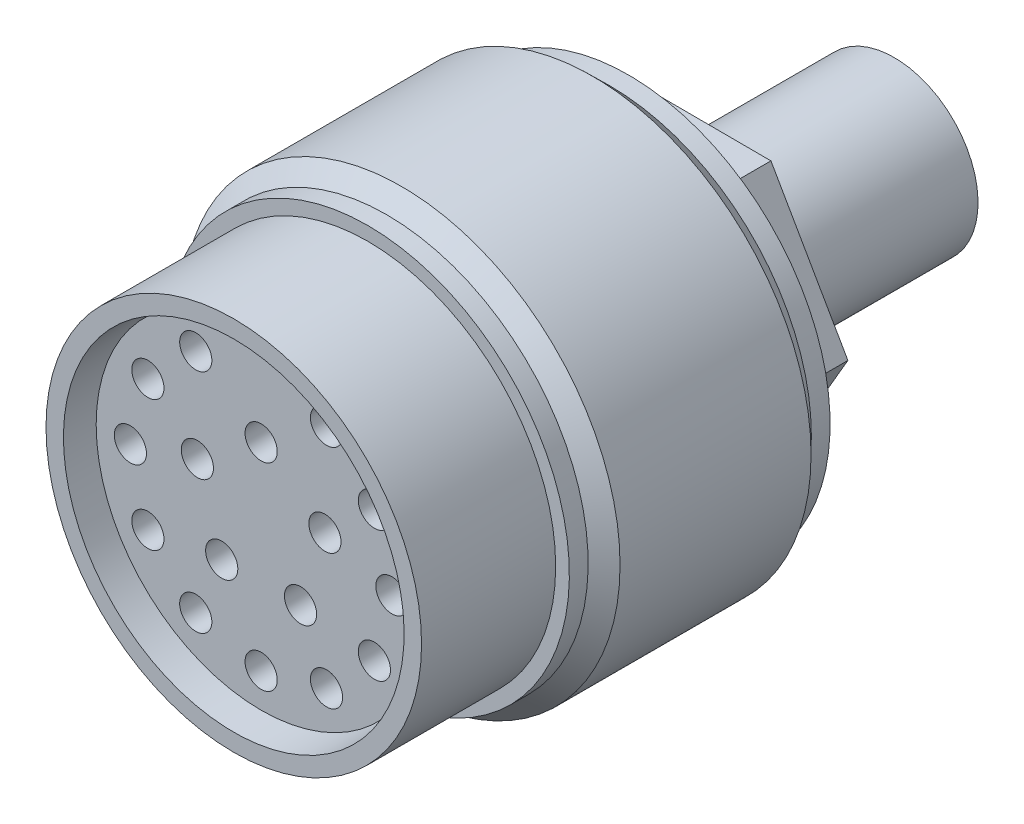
ISO-10303-21;
HEADER;
FILE_DESCRIPTION(('STEP AP214'),'2;1');
FILE_NAME('part.step','',(''),(''),'','','');
FILE_SCHEMA(('AUTOMOTIVE_DESIGN { 1 0 10303 214 1 1 1 1 }'));
ENDSEC;
DATA;
#1=APPLICATION_CONTEXT('core data for automotive mechanical design processes');
#2=APPLICATION_PROTOCOL_DEFINITION('international standard','automotive_design',2000,#1);
#3=PRODUCT_CONTEXT('',#1,'mechanical');
#4=PRODUCT('Part','Part','',(#3));
#5=PRODUCT_RELATED_PRODUCT_CATEGORY('part','',(#4));
#6=PRODUCT_DEFINITION_FORMATION('','',#4);
#7=PRODUCT_DEFINITION_CONTEXT('part definition',#1,'design');
#8=PRODUCT_DEFINITION('design','',#6,#7);
#9=PRODUCT_DEFINITION_SHAPE('','',#8);
#10=(LENGTH_UNIT() NAMED_UNIT(*) SI_UNIT(.MILLI.,.METRE.));
#11=(NAMED_UNIT(*) PLANE_ANGLE_UNIT() SI_UNIT($,.RADIAN.));
#12=(NAMED_UNIT(*) SI_UNIT($,.STERADIAN.) SOLID_ANGLE_UNIT());
#13=UNCERTAINTY_MEASURE_WITH_UNIT(LENGTH_MEASURE(1.E-05),#10,'distance_accuracy_value','');
#14=(GEOMETRIC_REPRESENTATION_CONTEXT(3) GLOBAL_UNCERTAINTY_ASSIGNED_CONTEXT((#13)) GLOBAL_UNIT_ASSIGNED_CONTEXT((#10,
#11,#12)) REPRESENTATION_CONTEXT('',''));
#15=CARTESIAN_POINT('',(0.,0.,0.));
#16=DIRECTION('',(0.,0.,1.));
#17=DIRECTION('',(1.,0.,0.));
#18=AXIS2_PLACEMENT_3D('',#15,#16,#17);
#19=CARTESIAN_POINT('',(8.03275,-8.03275,-19.05));
#20=DIRECTION('',(0.,0.,-1.));
#21=DIRECTION('',(-1.,0.,0.));
#22=AXIS2_PLACEMENT_3D('',#19,#20,#21);
#23=PLANE('',#22);
#24=CARTESIAN_POINT('',(0.,0.,-19.05));
#25=DIRECTION('',(0.,0.,1.));
#26=DIRECTION('',(0.,-1.,0.));
#27=AXIS2_PLACEMENT_3D('',#24,#25,#26);
#28=CIRCLE('',#27,7.9375);
#29=CARTESIAN_POINT('',(0.,-7.9375,-19.05));
#30=VERTEX_POINT('',#29);
#31=EDGE_CURVE('E20',#30,#30,#28,.F.);
#32=ORIENTED_EDGE('',*,*,#31,.T.);
#33=EDGE_LOOP('',(#32));
#34=FACE_BOUND('',#33,.T.);
#35=ADVANCED_FACE('F16',(#34),#23,.T.);
#36=CARTESIAN_POINT('',(0.,0.,-19.05));
#37=DIRECTION('',(0.,0.,1.));
#38=DIRECTION('',(0.,-1.,0.));
#39=AXIS2_PLACEMENT_3D('',#36,#37,#38);
#40=CYLINDRICAL_SURFACE('',#39,7.9375);
#41=ORIENTED_EDGE('',*,*,#31,.F.);
#42=EDGE_LOOP('',(#41));
#43=FACE_BOUND('',#42,.T.);
#44=CARTESIAN_POINT('',(0.,0.,-2.54));
#45=DIRECTION('',(0.,0.,1.));
#46=DIRECTION('',(0.,-1.,0.));
#47=AXIS2_PLACEMENT_3D('',#44,#45,#46);
#48=CIRCLE('',#47,7.9375);
#49=CARTESIAN_POINT('',(0.,-7.9375,-2.54));
#50=VERTEX_POINT('',#49);
#51=EDGE_CURVE('E274',#50,#50,#48,.F.);
#52=ORIENTED_EDGE('',*,*,#51,.T.);
#53=EDGE_LOOP('',(#52));
#54=FACE_BOUND('',#53,.T.);
#55=ADVANCED_FACE('F284',(#43,#54),#40,.T.);
#56=CARTESIAN_POINT('',(8.03275,-8.03275,-2.54));
#57=DIRECTION('',(0.,0.,-1.));
#58=DIRECTION('',(-1.,0.,0.));
#59=AXIS2_PLACEMENT_3D('',#56,#57,#58);
#60=PLANE('',#59);
#61=CARTESIAN_POINT('',(0.,0.,-2.54));
#62=DIRECTION('',(0.,0.,1.));
#63=DIRECTION('',(1.,0.,0.));
#64=AXIS2_PLACEMENT_3D('',#61,#62,#63);
#65=CIRCLE('',#64,7.62);
#66=CARTESIAN_POINT('',(7.62,0.,-2.54));
#67=VERTEX_POINT('',#66);
#68=EDGE_CURVE('E271',#67,#67,#65,.F.);
#69=ORIENTED_EDGE('',*,*,#68,.T.);
#70=EDGE_LOOP('',(#69));
#71=FACE_BOUND('',#70,.T.);
#72=ORIENTED_EDGE('',*,*,#51,.F.);
#73=EDGE_LOOP('',(#72));
#74=FACE_BOUND('',#73,.T.);
#75=ADVANCED_FACE('F286',(#71,#74),#60,.F.);
#76=CARTESIAN_POINT('',(0.,0.,-2.54));
#77=DIRECTION('',(0.,0.,1.));
#78=DIRECTION('',(1.,0.,0.));
#79=AXIS2_PLACEMENT_3D('',#76,#77,#78);
#80=CYLINDRICAL_SURFACE('',#79,7.62);
#81=CARTESIAN_POINT('',(0.,0.,0.));
#82=DIRECTION('',(0.,0.,1.));
#83=DIRECTION('',(1.,0.,0.));
#84=AXIS2_PLACEMENT_3D('',#81,#82,#83);
#85=CIRCLE('',#84,7.62);
#86=CARTESIAN_POINT('',(7.62,0.,0.));
#87=VERTEX_POINT('',#86);
#88=EDGE_CURVE('E93',#87,#87,#85,.T.);
#89=ORIENTED_EDGE('',*,*,#88,.F.);
#90=EDGE_LOOP('',(#89));
#91=FACE_BOUND('',#90,.T.);
#92=ORIENTED_EDGE('',*,*,#68,.F.);
#93=EDGE_LOOP('',(#92));
#94=FACE_BOUND('',#93,.T.);
#95=ADVANCED_FACE('F293',(#91,#94),#80,.T.);
#96=CARTESIAN_POINT('',(14.840580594,-12.878533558,0.));
#97=DIRECTION('',(0.,0.,-1.));
#98=DIRECTION('',(-1.,0.,0.));
#99=AXIS2_PLACEMENT_3D('',#96,#97,#98);
#100=PLANE('',#99);
#101=ORIENTED_EDGE('',*,*,#88,.T.);
#102=EDGE_LOOP('',(#101));
#103=FACE_BOUND('',#102,.T.);
#104=DIRECTION('',(0.496937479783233,-0.867786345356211,0.));
#105=VECTOR('',#104,1.);
#106=CARTESIAN_POINT('',(11.020886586,6.311105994,0.));
#107=LINE('',#106,#105);
#108=CARTESIAN_POINT('',(7.37716783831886,12.6740178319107,0.));
#109=VERTEX_POINT('',#108);
#110=CARTESIAN_POINT('',(14.6646053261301,-0.0518058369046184,0.));
#111=VERTEX_POINT('',#110);
#112=EDGE_CURVE('E112',#109,#111,#107,.T.);
#113=ORIENTED_EDGE('',*,*,#112,.T.);
#114=DIRECTION('',(-0.503056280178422,-0.864253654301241,0.));
#115=VECTOR('',#114,1.);
#116=CARTESIAN_POINT('',(10.9760214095,-6.3888147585,0.));
#117=LINE('',#116,#115);
#118=CARTESIAN_POINT('',(7.28743748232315,-12.7258236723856,0.));
#119=VERTEX_POINT('',#118);
#120=EDGE_CURVE('E121',#111,#119,#117,.T.);
#121=ORIENTED_EDGE('',*,*,#120,.T.);
#122=DIRECTION('',(-0.999993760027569,0.0035326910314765,0.));
#123=VECTOR('',#122,1.);
#124=CARTESIAN_POINT('',(-0.0448651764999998,-12.6999207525,0.));
#125=LINE('',#124,#123);
#126=CARTESIAN_POINT('',(-7.37716783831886,-12.6740178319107,0.));
#127=VERTEX_POINT('',#126);
#128=EDGE_CURVE('E120',#119,#127,#125,.T.);
#129=ORIENTED_EDGE('',*,*,#128,.T.);
#130=DIRECTION('',(-0.496937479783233,0.867786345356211,0.));
#131=VECTOR('',#130,1.);
#132=CARTESIAN_POINT('',(-11.020886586,-6.311105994,0.));
#133=LINE('',#132,#131);
#134=CARTESIAN_POINT('',(-14.6646053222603,0.0518058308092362,0.));
#135=VERTEX_POINT('',#134);
#136=EDGE_CURVE('E73',#127,#135,#133,.T.);
#137=ORIENTED_EDGE('',*,*,#136,.T.);
#138=DIRECTION('',(0.503056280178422,0.864253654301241,0.));
#139=VECTOR('',#138,1.);
#140=CARTESIAN_POINT('',(-10.9760214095,6.3888147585,0.));
#141=LINE('',#140,#139);
#142=CARTESIAN_POINT('',(-7.28743748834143,12.7258236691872,0.));
#143=VERTEX_POINT('',#142);
#144=EDGE_CURVE('E88',#135,#143,#141,.T.);
#145=ORIENTED_EDGE('',*,*,#144,.T.);
#146=DIRECTION('',(0.999993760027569,-0.0035326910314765,0.));
#147=VECTOR('',#146,1.);
#148=CARTESIAN_POINT('',(0.0448651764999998,12.6999207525,0.));
#149=LINE('',#148,#147);
#150=EDGE_CURVE('E86',#143,#109,#149,.T.);
#151=ORIENTED_EDGE('',*,*,#150,.T.);
#152=EDGE_LOOP('',(#113,#121,#129,#137,#145,#151));
#153=FACE_BOUND('',#152,.T.);
#154=ADVANCED_FACE('F90',(#103,#153),#100,.T.);
#155=CARTESIAN_POINT('',(-14.66460533,0.051805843,0.));
#156=DIRECTION('',(0.864253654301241,-0.503056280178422,0.));
#157=DIRECTION('',(0.503056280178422,0.864253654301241,0.));
#158=AXIS2_PLACEMENT_3D('',#155,#156,#157);
#159=PLANE('',#158);
#160=DIRECTION('',(0.,0.,-1.));
#161=VECTOR('',#160,1.);
#162=CARTESIAN_POINT('',(-7.287437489,12.725823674,3.048));
#163=LINE('',#162,#161);
#164=CARTESIAN_POINT('',(-7.287437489,12.725823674,6.096));
#165=VERTEX_POINT('',#164);
#166=EDGE_CURVE('E92',#165,#143,#163,.T.);
#167=ORIENTED_EDGE('',*,*,#166,.T.);
#168=ORIENTED_EDGE('',*,*,#144,.F.);
#169=DIRECTION('',(0.,0.,1.));
#170=VECTOR('',#169,1.);
#171=CARTESIAN_POINT('',(-14.66460533,0.051805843,3.048));
#172=LINE('',#171,#170);
#173=CARTESIAN_POINT('',(-14.66460533,0.0518058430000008,6.096));
#174=VERTEX_POINT('',#173);
#175=EDGE_CURVE('E62',#135,#174,#172,.T.);
#176=ORIENTED_EDGE('',*,*,#175,.T.);
#177=DIRECTION('',(0.503056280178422,0.864253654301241,0.));
#178=VECTOR('',#177,1.);
#179=CARTESIAN_POINT('',(-14.66460533,0.051805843,6.096));
#180=LINE('',#179,#178);
#181=EDGE_CURVE('E98',#174,#165,#180,.T.);
#182=ORIENTED_EDGE('',*,*,#181,.T.);
#183=EDGE_LOOP('',(#167,#168,#176,#182));
#184=FACE_BOUND('',#183,.T.);
#185=ADVANCED_FACE('F96',(#184),#159,.F.);
#186=CARTESIAN_POINT('',(-7.287437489,12.725823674,0.));
#187=DIRECTION('',(-0.0035326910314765,-0.999993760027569,0.));
#188=DIRECTION('',(0.999993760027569,-0.0035326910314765,0.));
#189=AXIS2_PLACEMENT_3D('',#186,#187,#188);
#190=PLANE('',#189);
#191=DIRECTION('',(0.,0.,-1.));
#192=VECTOR('',#191,1.);
#193=CARTESIAN_POINT('',(7.377167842,12.674017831,3.048));
#194=LINE('',#193,#192);
#195=CARTESIAN_POINT('',(7.377167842,12.674017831,6.096));
#196=VERTEX_POINT('',#195);
#197=EDGE_CURVE('E105',#196,#109,#194,.T.);
#198=ORIENTED_EDGE('',*,*,#197,.T.);
#199=ORIENTED_EDGE('',*,*,#150,.F.);
#200=ORIENTED_EDGE('',*,*,#166,.F.);
#201=DIRECTION('',(0.999993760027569,-0.0035326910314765,0.));
#202=VECTOR('',#201,1.);
#203=CARTESIAN_POINT('',(-7.287437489,12.725823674,6.096));
#204=LINE('',#203,#202);
#205=EDGE_CURVE('E264',#165,#196,#204,.T.);
#206=ORIENTED_EDGE('',*,*,#205,.T.);
#207=EDGE_LOOP('',(#198,#199,#200,#206));
#208=FACE_BOUND('',#207,.T.);
#209=ADVANCED_FACE('F103',(#208),#190,.F.);
#210=CARTESIAN_POINT('',(7.377167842,12.674017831,0.));
#211=DIRECTION('',(-0.867786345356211,-0.496937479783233,0.));
#212=DIRECTION('',(0.496937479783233,-0.867786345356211,0.));
#213=AXIS2_PLACEMENT_3D('',#210,#211,#212);
#214=PLANE('',#213);
#215=DIRECTION('',(0.,0.,-1.));
#216=VECTOR('',#215,1.);
#217=CARTESIAN_POINT('',(14.66460533,-0.051805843,3.048));
#218=LINE('',#217,#216);
#219=CARTESIAN_POINT('',(14.66460533,-0.0518058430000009,6.096));
#220=VERTEX_POINT('',#219);
#221=EDGE_CURVE('E125',#220,#111,#218,.T.);
#222=ORIENTED_EDGE('',*,*,#221,.T.);
#223=ORIENTED_EDGE('',*,*,#112,.F.);
#224=ORIENTED_EDGE('',*,*,#197,.F.);
#225=DIRECTION('',(0.496937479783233,-0.867786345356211,0.));
#226=VECTOR('',#225,1.);
#227=CARTESIAN_POINT('',(7.377167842,12.674017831,6.096));
#228=LINE('',#227,#226);
#229=EDGE_CURVE('E261',#196,#220,#228,.T.);
#230=ORIENTED_EDGE('',*,*,#229,.T.);
#231=EDGE_LOOP('',(#222,#223,#224,#230));
#232=FACE_BOUND('',#231,.T.);
#233=ADVANCED_FACE('F423',(#232),#214,.F.);
#234=CARTESIAN_POINT('',(14.66460533,-0.051805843,0.));
#235=DIRECTION('',(-0.864253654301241,0.503056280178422,0.));
#236=DIRECTION('',(-0.503056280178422,-0.864253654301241,0.));
#237=AXIS2_PLACEMENT_3D('',#234,#235,#236);
#238=PLANE('',#237);
#239=DIRECTION('',(0.,0.,-1.));
#240=VECTOR('',#239,1.);
#241=CARTESIAN_POINT('',(7.287437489,-12.725823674,3.048));
#242=LINE('',#241,#240);
#243=CARTESIAN_POINT('',(7.287437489,-12.725823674,6.096));
#244=VERTEX_POINT('',#243);
#245=EDGE_CURVE('E117',#244,#119,#242,.T.);
#246=ORIENTED_EDGE('',*,*,#245,.T.);
#247=ORIENTED_EDGE('',*,*,#120,.F.);
#248=ORIENTED_EDGE('',*,*,#221,.F.);
#249=DIRECTION('',(-0.503056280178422,-0.864253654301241,0.));
#250=VECTOR('',#249,1.);
#251=CARTESIAN_POINT('',(14.66460533,-0.051805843,6.096));
#252=LINE('',#251,#250);
#253=EDGE_CURVE('E258',#220,#244,#252,.T.);
#254=ORIENTED_EDGE('',*,*,#253,.T.);
#255=EDGE_LOOP('',(#246,#247,#248,#254));
#256=FACE_BOUND('',#255,.T.);
#257=ADVANCED_FACE('F426',(#256),#238,.F.);
#258=CARTESIAN_POINT('',(7.287437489,-12.725823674,0.));
#259=DIRECTION('',(0.0035326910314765,0.999993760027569,0.));
#260=DIRECTION('',(-0.999993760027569,0.0035326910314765,0.));
#261=AXIS2_PLACEMENT_3D('',#258,#259,#260);
#262=PLANE('',#261);
#263=DIRECTION('',(0.,0.,-1.));
#264=VECTOR('',#263,1.);
#265=CARTESIAN_POINT('',(-7.377167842,-12.674017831,3.048));
#266=LINE('',#265,#264);
#267=CARTESIAN_POINT('',(-7.377167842,-12.674017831,6.096));
#268=VERTEX_POINT('',#267);
#269=EDGE_CURVE('E122',#268,#127,#266,.T.);
#270=ORIENTED_EDGE('',*,*,#269,.T.);
#271=ORIENTED_EDGE('',*,*,#128,.F.);
#272=ORIENTED_EDGE('',*,*,#245,.F.);
#273=DIRECTION('',(-0.999993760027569,0.0035326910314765,0.));
#274=VECTOR('',#273,1.);
#275=CARTESIAN_POINT('',(7.287437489,-12.725823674,6.096));
#276=LINE('',#275,#274);
#277=EDGE_CURVE('E39',#244,#268,#276,.T.);
#278=ORIENTED_EDGE('',*,*,#277,.T.);
#279=EDGE_LOOP('',(#270,#271,#272,#278));
#280=FACE_BOUND('',#279,.T.);
#281=ADVANCED_FACE('F430',(#280),#262,.F.);
#282=CARTESIAN_POINT('',(-7.377167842,-12.674017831,0.));
#283=DIRECTION('',(0.867786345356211,0.496937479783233,0.));
#284=DIRECTION('',(-0.496937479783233,0.867786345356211,0.));
#285=AXIS2_PLACEMENT_3D('',#282,#283,#284);
#286=PLANE('',#285);
#287=ORIENTED_EDGE('',*,*,#175,.F.);
#288=ORIENTED_EDGE('',*,*,#136,.F.);
#289=ORIENTED_EDGE('',*,*,#269,.F.);
#290=DIRECTION('',(-0.496937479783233,0.867786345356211,0.));
#291=VECTOR('',#290,1.);
#292=CARTESIAN_POINT('',(-7.377167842,-12.674017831,6.096));
#293=LINE('',#292,#291);
#294=EDGE_CURVE('E253',#268,#174,#293,.T.);
#295=ORIENTED_EDGE('',*,*,#294,.T.);
#296=EDGE_LOOP('',(#287,#288,#289,#295));
#297=FACE_BOUND('',#296,.T.);
#298=ADVANCED_FACE('F434',(#297),#286,.F.);
#299=CARTESIAN_POINT('',(-19.3043048,-19.3043048,6.096));
#300=DIRECTION('',(0.,0.,1.));
#301=DIRECTION('',(1.,0.,0.));
#302=AXIS2_PLACEMENT_3D('',#299,#300,#301);
#303=PLANE('',#302);
#304=ORIENTED_EDGE('',*,*,#277,.F.);
#305=ORIENTED_EDGE('',*,*,#253,.F.);
#306=ORIENTED_EDGE('',*,*,#229,.F.);
#307=ORIENTED_EDGE('',*,*,#205,.F.);
#308=ORIENTED_EDGE('',*,*,#181,.F.);
#309=ORIENTED_EDGE('',*,*,#294,.F.);
#310=EDGE_LOOP('',(#304,#305,#306,#307,#308,#309));
#311=FACE_BOUND('',#310,.T.);
#312=CARTESIAN_POINT('',(0.,0.,6.096));
#313=DIRECTION('',(0.,0.,-1.));
#314=DIRECTION('',(-1.,0.,0.));
#315=AXIS2_PLACEMENT_3D('',#312,#313,#314);
#316=CIRCLE('',#315,19.0754);
#317=CARTESIAN_POINT('',(-19.0754,0.,6.096));
#318=VERTEX_POINT('',#317);
#319=EDGE_CURVE('E248',#318,#318,#316,.T.);
#320=ORIENTED_EDGE('',*,*,#319,.T.);
#321=EDGE_LOOP('',(#320));
#322=FACE_BOUND('',#321,.T.);
#323=ADVANCED_FACE('F403',(#311,#322),#303,.F.);
#324=CARTESIAN_POINT('',(0.,0.,7.874));
#325=DIRECTION('',(0.,0.,-1.));
#326=DIRECTION('',(-1.,0.,0.));
#327=AXIS2_PLACEMENT_3D('',#324,#325,#326);
#328=CYLINDRICAL_SURFACE('',#327,19.0754);
#329=ORIENTED_EDGE('',*,*,#319,.F.);
#330=EDGE_LOOP('',(#329));
#331=FACE_BOUND('',#330,.T.);
#332=CARTESIAN_POINT('',(0.,0.,7.87400000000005));
#333=DIRECTION('',(0.,0.,1.));
#334=DIRECTION('',(1.,0.,0.));
#335=AXIS2_PLACEMENT_3D('',#332,#333,#334);
#336=CIRCLE('',#335,19.0754);
#337=CARTESIAN_POINT('',(19.0754,0.,7.874));
#338=VERTEX_POINT('',#337);
#339=EDGE_CURVE('E252',#338,#338,#336,.F.);
#340=ORIENTED_EDGE('',*,*,#339,.T.);
#341=EDGE_LOOP('',(#340));
#342=FACE_BOUND('',#341,.T.);
#343=ADVANCED_FACE('F400',(#331,#342),#328,.T.);
#344=CARTESIAN_POINT('',(0.,0.,7.874));
#345=DIRECTION('',(0.,0.,1.));
#346=DIRECTION('',(1.,0.,0.));
#347=AXIS2_PLACEMENT_3D('',#344,#345,#346);
#348=CONICAL_SURFACE('',#347,19.0754,0.777646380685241);
#349=CARTESIAN_POINT('',(0.,0.,9.525));
#350=DIRECTION('',(0.,0.,-1.));
#351=DIRECTION('',(-1.,0.,0.));
#352=AXIS2_PLACEMENT_3D('',#349,#350,#351);
#353=CIRCLE('',#352,20.701);
#354=CARTESIAN_POINT('',(-20.701,0.,9.525));
#355=VERTEX_POINT('',#354);
#356=EDGE_CURVE('E927',#355,#355,#353,.T.);
#357=ORIENTED_EDGE('',*,*,#356,.T.);
#358=EDGE_LOOP('',(#357));
#359=FACE_BOUND('',#358,.T.);
#360=ORIENTED_EDGE('',*,*,#339,.F.);
#361=EDGE_LOOP('',(#360));
#362=FACE_BOUND('',#361,.T.);
#363=ADVANCED_FACE('F396',(#359,#362),#348,.T.);
#364=CARTESIAN_POINT('',(0.,0.,27.6098));
#365=DIRECTION('',(0.,0.,-1.));
#366=DIRECTION('',(-1.,0.,0.));
#367=AXIS2_PLACEMENT_3D('',#364,#365,#366);
#368=CYLINDRICAL_SURFACE('',#367,20.701);
#369=ORIENTED_EDGE('',*,*,#356,.F.);
#370=EDGE_LOOP('',(#369));
#371=FACE_BOUND('',#370,.T.);
#372=CARTESIAN_POINT('',(0.,0.,27.6098));
#373=DIRECTION('',(0.,0.,-1.));
#374=DIRECTION('',(-1.,0.,0.));
#375=AXIS2_PLACEMENT_3D('',#372,#373,#374);
#376=CIRCLE('',#375,20.701);
#377=CARTESIAN_POINT('',(-20.701,0.,27.6098));
#378=VERTEX_POINT('',#377);
#379=EDGE_CURVE('E931',#378,#378,#376,.T.);
#380=ORIENTED_EDGE('',*,*,#379,.T.);
#381=EDGE_LOOP('',(#380));
#382=FACE_BOUND('',#381,.T.);
#383=ADVANCED_FACE('F392',(#371,#382),#368,.T.);
#384=CARTESIAN_POINT('',(0.,0.,29.0068));
#385=DIRECTION('',(0.,0.,-1.));
#386=DIRECTION('',(-1.,0.,0.));
#387=AXIS2_PLACEMENT_3D('',#384,#385,#386);
#388=CONICAL_SURFACE('',#387,19.0754,0.860884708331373);
#389=ORIENTED_EDGE('',*,*,#379,.F.);
#390=EDGE_LOOP('',(#389));
#391=FACE_BOUND('',#390,.T.);
#392=CARTESIAN_POINT('',(0.,0.,29.0068));
#393=DIRECTION('',(0.,0.,-1.));
#394=DIRECTION('',(-1.,0.,0.));
#395=AXIS2_PLACEMENT_3D('',#392,#393,#394);
#396=CIRCLE('',#395,19.0754);
#397=CARTESIAN_POINT('',(-19.0754,0.,29.0068));
#398=VERTEX_POINT('',#397);
#399=EDGE_CURVE('E247',#398,#398,#396,.T.);
#400=ORIENTED_EDGE('',*,*,#399,.T.);
#401=EDGE_LOOP('',(#400));
#402=FACE_BOUND('',#401,.T.);
#403=ADVANCED_FACE('F388',(#391,#402),#388,.T.);
#404=CARTESIAN_POINT('',(0.,0.,30.7848));
#405=DIRECTION('',(0.,0.,-1.));
#406=DIRECTION('',(0.,1.,0.));
#407=AXIS2_PLACEMENT_3D('',#404,#405,#406);
#408=CYLINDRICAL_SURFACE('',#407,19.0754);
#409=ORIENTED_EDGE('',*,*,#399,.F.);
#410=EDGE_LOOP('',(#409));
#411=FACE_BOUND('',#410,.T.);
#412=CARTESIAN_POINT('',(0.,0.,30.7848));
#413=DIRECTION('',(0.,0.,-1.));
#414=DIRECTION('',(0.,1.,0.));
#415=AXIS2_PLACEMENT_3D('',#412,#413,#414);
#416=CIRCLE('',#415,19.0754);
#417=CARTESIAN_POINT('',(0.,19.0754,30.7848));
#418=VERTEX_POINT('',#417);
#419=EDGE_CURVE('E244',#418,#418,#416,.T.);
#420=ORIENTED_EDGE('',*,*,#419,.T.);
#421=EDGE_LOOP('',(#420));
#422=FACE_BOUND('',#421,.T.);
#423=ADVANCED_FACE('F385',(#411,#422),#408,.T.);
#424=CARTESIAN_POINT('',(19.3043048,-19.3043048,30.7848));
#425=DIRECTION('',(0.,0.,-1.));
#426=DIRECTION('',(-1.,0.,0.));
#427=AXIS2_PLACEMENT_3D('',#424,#425,#426);
#428=PLANE('',#427);
#429=CARTESIAN_POINT('',(0.,0.,30.7848));
#430=DIRECTION('',(0.,0.,-1.));
#431=DIRECTION('',(0.,1.,0.));
#432=AXIS2_PLACEMENT_3D('',#429,#430,#431);
#433=CIRCLE('',#432,17.78);
#434=CARTESIAN_POINT('',(0.,17.78,30.7848));
#435=VERTEX_POINT('',#434);
#436=EDGE_CURVE('E241',#435,#435,#433,.T.);
#437=ORIENTED_EDGE('',*,*,#436,.T.);
#438=EDGE_LOOP('',(#437));
#439=FACE_BOUND('',#438,.T.);
#440=ORIENTED_EDGE('',*,*,#419,.F.);
#441=EDGE_LOOP('',(#440));
#442=FACE_BOUND('',#441,.T.);
#443=ADVANCED_FACE('F383',(#439,#442),#428,.F.);
#444=CARTESIAN_POINT('',(0.,0.,43.4848));
#445=DIRECTION('',(0.,0.,-1.));
#446=DIRECTION('',(0.,1.,0.));
#447=AXIS2_PLACEMENT_3D('',#444,#445,#446);
#448=CYLINDRICAL_SURFACE('',#447,17.78);
#449=ORIENTED_EDGE('',*,*,#436,.F.);
#450=EDGE_LOOP('',(#449));
#451=FACE_BOUND('',#450,.T.);
#452=CARTESIAN_POINT('',(0.,0.,43.4848));
#453=DIRECTION('',(0.,0.,-1.));
#454=DIRECTION('',(0.,1.,0.));
#455=AXIS2_PLACEMENT_3D('',#452,#453,#454);
#456=CIRCLE('',#455,17.78);
#457=CARTESIAN_POINT('',(0.,17.78,43.4848));
#458=VERTEX_POINT('',#457);
#459=EDGE_CURVE('E238',#458,#458,#456,.T.);
#460=ORIENTED_EDGE('',*,*,#459,.T.);
#461=EDGE_LOOP('',(#460));
#462=FACE_BOUND('',#461,.T.);
#463=ADVANCED_FACE('F379',(#451,#462),#448,.T.);
#464=CARTESIAN_POINT('',(17.99336,-17.99336,43.4848));
#465=DIRECTION('',(0.,0.,-1.));
#466=DIRECTION('',(-1.,0.,0.));
#467=AXIS2_PLACEMENT_3D('',#464,#465,#466);
#468=PLANE('',#467);
#469=CARTESIAN_POINT('',(0.,0.,43.4848));
#470=DIRECTION('',(0.,0.,-1.));
#471=DIRECTION('',(0.,1.,0.));
#472=AXIS2_PLACEMENT_3D('',#469,#470,#471);
#473=CIRCLE('',#472,16.129);
#474=CARTESIAN_POINT('',(0.,16.129,43.4848));
#475=VERTEX_POINT('',#474);
#476=EDGE_CURVE('E235',#475,#475,#473,.F.);
#477=ORIENTED_EDGE('',*,*,#476,.F.);
#478=EDGE_LOOP('',(#477));
#479=FACE_BOUND('',#478,.T.);
#480=ORIENTED_EDGE('',*,*,#459,.F.);
#481=EDGE_LOOP('',(#480));
#482=FACE_BOUND('',#481,.T.);
#483=ADVANCED_FACE('F382',(#479,#482),#468,.F.);
#484=CARTESIAN_POINT('',(4.095812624,2.952467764,24.384));
#485=DIRECTION('',(0.,0.,1.));
#486=DIRECTION('',(0.309016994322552,-0.951056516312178,0.));
#487=AXIS2_PLACEMENT_3D('',#484,#485,#486);
#488=PLANE('',#487);
#489=CARTESIAN_POINT('',(6.039208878,1.962257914,24.384));
#490=DIRECTION('',(0.,0.,1.));
#491=DIRECTION('',(1.,0.,0.));
#492=AXIS2_PLACEMENT_3D('',#489,#490,#491);
#493=CIRCLE('',#492,1.524);
#494=CARTESIAN_POINT('',(7.563208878,1.962257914,24.384));
#495=VERTEX_POINT('',#494);
#496=EDGE_CURVE('E232',#495,#495,#493,.F.);
#497=ORIENTED_EDGE('',*,*,#496,.F.);
#498=EDGE_LOOP('',(#497));
#499=FACE_BOUND('',#498,.T.);
#500=ADVANCED_FACE('F446',(#499),#488,.T.);
#501=CARTESIAN_POINT('',(4.073639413,-2.982986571,24.384));
#502=DIRECTION('',(0.,0.,1.));
#503=DIRECTION('',(-0.809016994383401,-0.587785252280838,0.));
#504=AXIS2_PLACEMENT_3D('',#501,#502,#503);
#505=PLANE('',#504);
#506=CARTESIAN_POINT('',(3.732436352,-5.137257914,24.384));
#507=DIRECTION('',(0.,0.,1.));
#508=DIRECTION('',(1.,0.,0.));
#509=AXIS2_PLACEMENT_3D('',#506,#507,#508);
#510=CIRCLE('',#509,1.524);
#511=CARTESIAN_POINT('',(5.256436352,-5.137257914,24.384));
#512=VERTEX_POINT('',#511);
#513=EDGE_CURVE('E229',#512,#512,#510,.F.);
#514=ORIENTED_EDGE('',*,*,#513,.F.);
#515=EDGE_LOOP('',(#514));
#516=FACE_BOUND('',#515,.T.);
#517=ADVANCED_FACE('F450',(#516),#505,.T.);
#518=CARTESIAN_POINT('',(-1.578165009,-4.796054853,24.384));
#519=DIRECTION('',(0.,0.,1.));
#520=DIRECTION('',(-0.809016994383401,0.587785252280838,0.));
#521=AXIS2_PLACEMENT_3D('',#518,#519,#520);
#522=PLANE('',#521);
#523=CARTESIAN_POINT('',(-3.732436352,-5.137257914,24.384));
#524=DIRECTION('',(0.,0.,1.));
#525=DIRECTION('',(1.,0.,0.));
#526=AXIS2_PLACEMENT_3D('',#523,#524,#525);
#527=CIRCLE('',#526,1.524);
#528=CARTESIAN_POINT('',(-2.208436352,-5.137257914,24.384));
#529=VERTEX_POINT('',#528);
#530=EDGE_CURVE('E226',#529,#529,#527,.F.);
#531=ORIENTED_EDGE('',*,*,#530,.F.);
#532=EDGE_LOOP('',(#531));
#533=FACE_BOUND('',#532,.T.);
#534=ADVANCED_FACE('F454',(#533),#522,.T.);
#535=CARTESIAN_POINT('',(-5.048999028,0.01886166,24.384));
#536=DIRECTION('',(0.,0.,1.));
#537=DIRECTION('',(0.309016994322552,0.951056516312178,0.));
#538=AXIS2_PLACEMENT_3D('',#535,#536,#537);
#539=PLANE('',#538);
#540=CARTESIAN_POINT('',(-6.039208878,1.962257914,24.384));
#541=DIRECTION('',(0.,0.,1.));
#542=DIRECTION('',(1.,0.,0.));
#543=AXIS2_PLACEMENT_3D('',#540,#541,#542);
#544=CIRCLE('',#543,1.524);
#545=CARTESIAN_POINT('',(-4.515208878,1.962257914,24.384));
#546=VERTEX_POINT('',#545);
#547=EDGE_CURVE('E223',#546,#546,#544,.F.);
#548=ORIENTED_EDGE('',*,*,#547,.F.);
#549=EDGE_LOOP('',(#548));
#550=FACE_BOUND('',#549,.T.);
#551=ADVANCED_FACE('F458',(#550),#539,.T.);
#552=CARTESIAN_POINT('',(-1.542288,4.807712,24.384));
#553=DIRECTION('',(0.,0.,1.));
#554=DIRECTION('',(1.,0.,0.));
#555=AXIS2_PLACEMENT_3D('',#552,#553,#554);
#556=PLANE('',#555);
#557=CARTESIAN_POINT('',(0.,6.35,24.384));
#558=DIRECTION('',(0.,0.,1.));
#559=DIRECTION('',(1.,0.,0.));
#560=AXIS2_PLACEMENT_3D('',#557,#558,#559);
#561=CIRCLE('',#560,1.524);
#562=CARTESIAN_POINT('',(1.524,6.35,24.384));
#563=VERTEX_POINT('',#562);
#564=EDGE_CURVE('E220',#563,#563,#561,.F.);
#565=ORIENTED_EDGE('',*,*,#564,.F.);
#566=EDGE_LOOP('',(#565));
#567=FACE_BOUND('',#566,.T.);
#568=ADVANCED_FACE('F462',(#567),#556,.T.);
#569=CARTESIAN_POINT('',(5.626733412,-12.83036415,24.384));
#570=DIRECTION('',(0.,0.,1.));
#571=DIRECTION('',(0.866025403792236,0.499999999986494,0.));
#572=AXIS2_PLACEMENT_3D('',#569,#570,#571);
#573=PLANE('',#572);
#574=CARTESIAN_POINT('',(6.19125,-10.723559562,24.384));
#575=DIRECTION('',(0.,0.,1.));
#576=DIRECTION('',(1.,0.,0.));
#577=AXIS2_PLACEMENT_3D('',#574,#575,#576);
#578=CIRCLE('',#577,1.524);
#579=CARTESIAN_POINT('',(7.71525,-10.723559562,24.384));
#580=VERTEX_POINT('',#579);
#581=EDGE_CURVE('E217',#580,#580,#578,.F.);
#582=ORIENTED_EDGE('',*,*,#581,.F.);
#583=EDGE_LOOP('',(#582));
#584=FACE_BOUND('',#583,.T.);
#585=ADVANCED_FACE('F466',(#584),#573,.T.);
#586=CARTESIAN_POINT('',(11.28807615,-8.298054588,24.384));
#587=DIRECTION('',(0.,0.,1.));
#588=DIRECTION('',(0.499999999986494,0.866025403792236,0.));
#589=AXIS2_PLACEMENT_3D('',#586,#587,#588);
#590=PLANE('',#589);
#591=CARTESIAN_POINT('',(10.723559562,-6.19125,24.384));
#592=DIRECTION('',(0.,0.,1.));
#593=DIRECTION('',(1.,0.,0.));
#594=AXIS2_PLACEMENT_3D('',#591,#592,#593);
#595=CIRCLE('',#594,1.524);
#596=CARTESIAN_POINT('',(12.247559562,-6.19125,24.384));
#597=VERTEX_POINT('',#596);
#598=EDGE_CURVE('E213',#597,#597,#595,.F.);
#599=ORIENTED_EDGE('',*,*,#598,.F.);
#600=EDGE_LOOP('',(#599));
#601=FACE_BOUND('',#600,.T.);
#602=ADVANCED_FACE('F470',(#601),#590,.T.);
#603=CARTESIAN_POINT('',(13.924788,-1.542288,24.384));
#604=DIRECTION('',(0.,0.,1.));
#605=DIRECTION('',(0.,1.,0.));
#606=AXIS2_PLACEMENT_3D('',#603,#604,#605);
#607=PLANE('',#606);
#608=CARTESIAN_POINT('',(12.3825,0.,24.384));
#609=DIRECTION('',(0.,0.,1.));
#610=DIRECTION('',(1.,0.,0.));
#611=AXIS2_PLACEMENT_3D('',#608,#609,#610);
#612=CIRCLE('',#611,1.524);
#613=CARTESIAN_POINT('',(13.9065,0.,24.384));
#614=VERTEX_POINT('',#613);
#615=EDGE_CURVE('E210',#614,#614,#612,.F.);
#616=ORIENTED_EDGE('',*,*,#615,.F.);
#617=EDGE_LOOP('',(#616));
#618=FACE_BOUND('',#617,.T.);
#619=ADVANCED_FACE('F474',(#618),#607,.T.);
#620=CARTESIAN_POINT('',(12.83036415,5.626733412,24.384));
#621=DIRECTION('',(0.,0.,1.));
#622=DIRECTION('',(-0.499999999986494,0.866025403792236,0.));
#623=AXIS2_PLACEMENT_3D('',#620,#621,#622);
#624=PLANE('',#623);
#625=CARTESIAN_POINT('',(10.723559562,6.19125,24.384));
#626=DIRECTION('',(0.,0.,1.));
#627=DIRECTION('',(1.,0.,0.));
#628=AXIS2_PLACEMENT_3D('',#625,#626,#627);
#629=CIRCLE('',#628,1.524);
#630=CARTESIAN_POINT('',(12.247559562,6.19125,24.384));
#631=VERTEX_POINT('',#630);
#632=EDGE_CURVE('E207',#631,#631,#629,.F.);
#633=ORIENTED_EDGE('',*,*,#632,.F.);
#634=EDGE_LOOP('',(#633));
#635=FACE_BOUND('',#634,.T.);
#636=ADVANCED_FACE('F478',(#635),#624,.T.);
#637=CARTESIAN_POINT('',(8.298054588,11.28807615,24.384));
#638=DIRECTION('',(0.,0.,1.));
#639=DIRECTION('',(-0.866025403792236,0.499999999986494,0.));
#640=AXIS2_PLACEMENT_3D('',#637,#638,#639);
#641=PLANE('',#640);
#642=CARTESIAN_POINT('',(6.19125,10.723559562,24.384));
#643=DIRECTION('',(0.,0.,1.));
#644=DIRECTION('',(1.,0.,0.));
#645=AXIS2_PLACEMENT_3D('',#642,#643,#644);
#646=CIRCLE('',#645,1.524);
#647=CARTESIAN_POINT('',(7.71525,10.723559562,24.384));
#648=VERTEX_POINT('',#647);
#649=EDGE_CURVE('E204',#648,#648,#646,.F.);
#650=ORIENTED_EDGE('',*,*,#649,.F.);
#651=EDGE_LOOP('',(#650));
#652=FACE_BOUND('',#651,.T.);
#653=ADVANCED_FACE('F482',(#652),#641,.T.);
#654=CARTESIAN_POINT('',(-5.626733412,12.83036415,24.384));
#655=DIRECTION('',(0.,0.,1.));
#656=DIRECTION('',(-0.866025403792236,-0.499999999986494,0.));
#657=AXIS2_PLACEMENT_3D('',#654,#655,#656);
#658=PLANE('',#657);
#659=CARTESIAN_POINT('',(-6.19125,10.723559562,24.384));
#660=DIRECTION('',(0.,0.,1.));
#661=DIRECTION('',(1.,0.,0.));
#662=AXIS2_PLACEMENT_3D('',#659,#660,#661);
#663=CIRCLE('',#662,1.524);
#664=CARTESIAN_POINT('',(-4.66725,10.723559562,24.384));
#665=VERTEX_POINT('',#664);
#666=EDGE_CURVE('E201',#665,#665,#663,.F.);
#667=ORIENTED_EDGE('',*,*,#666,.F.);
#668=EDGE_LOOP('',(#667));
#669=FACE_BOUND('',#668,.T.);
#670=ADVANCED_FACE('F486',(#669),#658,.T.);
#671=CARTESIAN_POINT('',(-11.28807615,8.298054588,24.384));
#672=DIRECTION('',(0.,0.,1.));
#673=DIRECTION('',(-0.499999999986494,-0.866025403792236,0.));
#674=AXIS2_PLACEMENT_3D('',#671,#672,#673);
#675=PLANE('',#674);
#676=CARTESIAN_POINT('',(-10.723559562,6.19125,24.384));
#677=DIRECTION('',(0.,0.,1.));
#678=DIRECTION('',(1.,0.,0.));
#679=AXIS2_PLACEMENT_3D('',#676,#677,#678);
#680=CIRCLE('',#679,1.524);
#681=CARTESIAN_POINT('',(-9.199559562,6.19125,24.384));
#682=VERTEX_POINT('',#681);
#683=EDGE_CURVE('E198',#682,#682,#680,.F.);
#684=ORIENTED_EDGE('',*,*,#683,.F.);
#685=EDGE_LOOP('',(#684));
#686=FACE_BOUND('',#685,.T.);
#687=ADVANCED_FACE('F490',(#686),#675,.T.);
#688=CARTESIAN_POINT('',(-13.924788,1.542288,24.384));
#689=DIRECTION('',(0.,0.,1.));
#690=DIRECTION('',(0.,-1.,0.));
#691=AXIS2_PLACEMENT_3D('',#688,#689,#690);
#692=PLANE('',#691);
#693=CARTESIAN_POINT('',(-12.3825,0.,24.384));
#694=DIRECTION('',(0.,0.,1.));
#695=DIRECTION('',(1.,0.,0.));
#696=AXIS2_PLACEMENT_3D('',#693,#694,#695);
#697=CIRCLE('',#696,1.524);
#698=CARTESIAN_POINT('',(-10.8585,0.,24.384));
#699=VERTEX_POINT('',#698);
#700=EDGE_CURVE('E195',#699,#699,#697,.F.);
#701=ORIENTED_EDGE('',*,*,#700,.F.);
#702=EDGE_LOOP('',(#701));
#703=FACE_BOUND('',#702,.T.);
#704=ADVANCED_FACE('F494',(#703),#692,.T.);
#705=CARTESIAN_POINT('',(-12.83036415,-5.626733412,24.384));
#706=DIRECTION('',(0.,0.,1.));
#707=DIRECTION('',(0.499999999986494,-0.866025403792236,0.));
#708=AXIS2_PLACEMENT_3D('',#705,#706,#707);
#709=PLANE('',#708);
#710=CARTESIAN_POINT('',(-10.723559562,-6.19125,24.384));
#711=DIRECTION('',(0.,0.,1.));
#712=DIRECTION('',(1.,0.,0.));
#713=AXIS2_PLACEMENT_3D('',#710,#711,#712);
#714=CIRCLE('',#713,1.524);
#715=CARTESIAN_POINT('',(-9.199559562,-6.19125,24.384));
#716=VERTEX_POINT('',#715);
#717=EDGE_CURVE('E192',#716,#716,#714,.F.);
#718=ORIENTED_EDGE('',*,*,#717,.F.);
#719=EDGE_LOOP('',(#718));
#720=FACE_BOUND('',#719,.T.);
#721=ADVANCED_FACE('F498',(#720),#709,.T.);
#722=CARTESIAN_POINT('',(-8.298054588,-11.28807615,24.384));
#723=DIRECTION('',(0.,0.,1.));
#724=DIRECTION('',(0.866025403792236,-0.499999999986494,0.));
#725=AXIS2_PLACEMENT_3D('',#722,#723,#724);
#726=PLANE('',#725);
#727=CARTESIAN_POINT('',(-6.19125,-10.723559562,24.384));
#728=DIRECTION('',(0.,0.,1.));
#729=DIRECTION('',(1.,0.,0.));
#730=AXIS2_PLACEMENT_3D('',#727,#728,#729);
#731=CIRCLE('',#730,1.524);
#732=CARTESIAN_POINT('',(-4.66725,-10.723559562,24.384));
#733=VERTEX_POINT('',#732);
#734=EDGE_CURVE('E189',#733,#733,#731,.F.);
#735=ORIENTED_EDGE('',*,*,#734,.F.);
#736=EDGE_LOOP('',(#735));
#737=FACE_BOUND('',#736,.T.);
#738=ADVANCED_FACE('F502',(#737),#726,.T.);
#739=CARTESIAN_POINT('',(-1.542288,-13.924788,24.384));
#740=DIRECTION('',(0.,0.,1.));
#741=DIRECTION('',(1.,0.,0.));
#742=AXIS2_PLACEMENT_3D('',#739,#740,#741);
#743=PLANE('',#742);
#744=CARTESIAN_POINT('',(0.,-12.3825,24.384));
#745=DIRECTION('',(0.,0.,1.));
#746=DIRECTION('',(1.,0.,0.));
#747=AXIS2_PLACEMENT_3D('',#744,#745,#746);
#748=CIRCLE('',#747,1.524);
#749=CARTESIAN_POINT('',(1.524,-12.3825,24.384));
#750=VERTEX_POINT('',#749);
#751=EDGE_CURVE('E186',#750,#750,#748,.F.);
#752=ORIENTED_EDGE('',*,*,#751,.F.);
#753=EDGE_LOOP('',(#752));
#754=FACE_BOUND('',#753,.T.);
#755=ADVANCED_FACE('F377',(#754),#743,.T.);
#756=CARTESIAN_POINT('',(0.,0.,43.4848));
#757=DIRECTION('',(0.,0.,-1.));
#758=DIRECTION('',(0.,1.,0.));
#759=AXIS2_PLACEMENT_3D('',#756,#757,#758);
#760=CYLINDRICAL_SURFACE('',#759,16.129);
#761=ORIENTED_EDGE('',*,*,#476,.T.);
#762=EDGE_LOOP('',(#761));
#763=FACE_BOUND('',#762,.T.);
#764=CARTESIAN_POINT('',(0.,0.,16.683081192));
#765=DIRECTION('',(0.,0.,-1.));
#766=DIRECTION('',(0.,1.,0.));
#767=AXIS2_PLACEMENT_3D('',#764,#765,#766);
#768=CIRCLE('',#767,16.129);
#769=CARTESIAN_POINT('',(0.,16.129,16.683081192));
#770=VERTEX_POINT('',#769);
#771=EDGE_CURVE('E182',#770,#770,#768,.T.);
#772=ORIENTED_EDGE('',*,*,#771,.T.);
#773=EDGE_LOOP('',(#772));
#774=FACE_BOUND('',#773,.T.);
#775=ADVANCED_FACE('F373',(#763,#774),#760,.F.);
#776=CARTESIAN_POINT('',(6.039208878,1.962257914,24.384));
#777=DIRECTION('',(0.,0.,1.));
#778=DIRECTION('',(1.,0.,0.));
#779=AXIS2_PLACEMENT_3D('',#776,#777,#778);
#780=CYLINDRICAL_SURFACE('',#779,1.524);
#781=CARTESIAN_POINT('',(6.039208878,1.962257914,40.894));
#782=DIRECTION('',(0.,0.,1.));
#783=DIRECTION('',(1.,0.,0.));
#784=AXIS2_PLACEMENT_3D('',#781,#782,#783);
#785=CIRCLE('',#784,1.524);
#786=CARTESIAN_POINT('',(7.563208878,1.962257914,40.894));
#787=VERTEX_POINT('',#786);
#788=EDGE_CURVE('E179',#787,#787,#785,.F.);
#789=ORIENTED_EDGE('',*,*,#788,.F.);
#790=EDGE_LOOP('',(#789));
#791=FACE_BOUND('',#790,.T.);
#792=ORIENTED_EDGE('',*,*,#496,.T.);
#793=EDGE_LOOP('',(#792));
#794=FACE_BOUND('',#793,.T.);
#795=ADVANCED_FACE('F369',(#791,#794),#780,.F.);
#796=CARTESIAN_POINT('',(3.732436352,-5.137257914,24.384));
#797=DIRECTION('',(0.,0.,1.));
#798=DIRECTION('',(1.,0.,0.));
#799=AXIS2_PLACEMENT_3D('',#796,#797,#798);
#800=CYLINDRICAL_SURFACE('',#799,1.524);
#801=CARTESIAN_POINT('',(3.732436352,-5.137257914,40.894));
#802=DIRECTION('',(0.,0.,1.));
#803=DIRECTION('',(1.,0.,0.));
#804=AXIS2_PLACEMENT_3D('',#801,#802,#803);
#805=CIRCLE('',#804,1.524);
#806=CARTESIAN_POINT('',(5.256436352,-5.137257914,40.894));
#807=VERTEX_POINT('',#806);
#808=EDGE_CURVE('E176',#807,#807,#805,.F.);
#809=ORIENTED_EDGE('',*,*,#808,.F.);
#810=EDGE_LOOP('',(#809));
#811=FACE_BOUND('',#810,.T.);
#812=ORIENTED_EDGE('',*,*,#513,.T.);
#813=EDGE_LOOP('',(#812));
#814=FACE_BOUND('',#813,.T.);
#815=ADVANCED_FACE('F365',(#811,#814),#800,.F.);
#816=CARTESIAN_POINT('',(-3.732436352,-5.137257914,24.384));
#817=DIRECTION('',(0.,0.,1.));
#818=DIRECTION('',(1.,0.,0.));
#819=AXIS2_PLACEMENT_3D('',#816,#817,#818);
#820=CYLINDRICAL_SURFACE('',#819,1.524);
#821=CARTESIAN_POINT('',(-3.732436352,-5.137257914,40.894));
#822=DIRECTION('',(0.,0.,1.));
#823=DIRECTION('',(1.,0.,0.));
#824=AXIS2_PLACEMENT_3D('',#821,#822,#823);
#825=CIRCLE('',#824,1.524);
#826=CARTESIAN_POINT('',(-2.208436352,-5.137257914,40.894));
#827=VERTEX_POINT('',#826);
#828=EDGE_CURVE('E173',#827,#827,#825,.F.);
#829=ORIENTED_EDGE('',*,*,#828,.F.);
#830=EDGE_LOOP('',(#829));
#831=FACE_BOUND('',#830,.T.);
#832=ORIENTED_EDGE('',*,*,#530,.T.);
#833=EDGE_LOOP('',(#832));
#834=FACE_BOUND('',#833,.T.);
#835=ADVANCED_FACE('F361',(#831,#834),#820,.F.);
#836=CARTESIAN_POINT('',(-6.039208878,1.962257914,24.384));
#837=DIRECTION('',(0.,0.,1.));
#838=DIRECTION('',(1.,0.,0.));
#839=AXIS2_PLACEMENT_3D('',#836,#837,#838);
#840=CYLINDRICAL_SURFACE('',#839,1.524);
#841=CARTESIAN_POINT('',(-6.039208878,1.962257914,40.894));
#842=DIRECTION('',(0.,0.,1.));
#843=DIRECTION('',(1.,0.,0.));
#844=AXIS2_PLACEMENT_3D('',#841,#842,#843);
#845=CIRCLE('',#844,1.524);
#846=CARTESIAN_POINT('',(-4.515208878,1.962257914,40.894));
#847=VERTEX_POINT('',#846);
#848=EDGE_CURVE('E170',#847,#847,#845,.F.);
#849=ORIENTED_EDGE('',*,*,#848,.F.);
#850=EDGE_LOOP('',(#849));
#851=FACE_BOUND('',#850,.T.);
#852=ORIENTED_EDGE('',*,*,#547,.T.);
#853=EDGE_LOOP('',(#852));
#854=FACE_BOUND('',#853,.T.);
#855=ADVANCED_FACE('F357',(#851,#854),#840,.F.);
#856=CARTESIAN_POINT('',(0.,6.35,24.384));
#857=DIRECTION('',(0.,0.,1.));
#858=DIRECTION('',(1.,0.,0.));
#859=AXIS2_PLACEMENT_3D('',#856,#857,#858);
#860=CYLINDRICAL_SURFACE('',#859,1.524);
#861=CARTESIAN_POINT('',(0.,6.35,40.894));
#862=DIRECTION('',(0.,0.,1.));
#863=DIRECTION('',(1.,0.,0.));
#864=AXIS2_PLACEMENT_3D('',#861,#862,#863);
#865=CIRCLE('',#864,1.524);
#866=CARTESIAN_POINT('',(1.524,6.35,40.894));
#867=VERTEX_POINT('',#866);
#868=EDGE_CURVE('E167',#867,#867,#865,.F.);
#869=ORIENTED_EDGE('',*,*,#868,.F.);
#870=EDGE_LOOP('',(#869));
#871=FACE_BOUND('',#870,.T.);
#872=ORIENTED_EDGE('',*,*,#564,.T.);
#873=EDGE_LOOP('',(#872));
#874=FACE_BOUND('',#873,.T.);
#875=ADVANCED_FACE('F353',(#871,#874),#860,.F.);
#876=CARTESIAN_POINT('',(6.19125,-10.723559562,24.384));
#877=DIRECTION('',(0.,0.,1.));
#878=DIRECTION('',(1.,0.,0.));
#879=AXIS2_PLACEMENT_3D('',#876,#877,#878);
#880=CYLINDRICAL_SURFACE('',#879,1.524);
#881=CARTESIAN_POINT('',(6.19125,-10.723559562,40.894));
#882=DIRECTION('',(0.,0.,1.));
#883=DIRECTION('',(1.,0.,0.));
#884=AXIS2_PLACEMENT_3D('',#881,#882,#883);
#885=CIRCLE('',#884,1.524);
#886=CARTESIAN_POINT('',(7.71525,-10.723559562,40.894));
#887=VERTEX_POINT('',#886);
#888=EDGE_CURVE('E164',#887,#887,#885,.F.);
#889=ORIENTED_EDGE('',*,*,#888,.F.);
#890=EDGE_LOOP('',(#889));
#891=FACE_BOUND('',#890,.T.);
#892=ORIENTED_EDGE('',*,*,#581,.T.);
#893=EDGE_LOOP('',(#892));
#894=FACE_BOUND('',#893,.T.);
#895=ADVANCED_FACE('F349',(#891,#894),#880,.F.);
#896=CARTESIAN_POINT('',(10.723559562,-6.19125,24.384));
#897=DIRECTION('',(0.,0.,1.));
#898=DIRECTION('',(1.,0.,0.));
#899=AXIS2_PLACEMENT_3D('',#896,#897,#898);
#900=CYLINDRICAL_SURFACE('',#899,1.524);
#901=CARTESIAN_POINT('',(10.723559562,-6.19125,40.894));
#902=DIRECTION('',(0.,0.,1.));
#903=DIRECTION('',(1.,0.,0.));
#904=AXIS2_PLACEMENT_3D('',#901,#902,#903);
#905=CIRCLE('',#904,1.524);
#906=CARTESIAN_POINT('',(12.247559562,-6.19125,40.894));
#907=VERTEX_POINT('',#906);
#908=EDGE_CURVE('E161',#907,#907,#905,.F.);
#909=ORIENTED_EDGE('',*,*,#908,.F.);
#910=EDGE_LOOP('',(#909));
#911=FACE_BOUND('',#910,.T.);
#912=ORIENTED_EDGE('',*,*,#598,.T.);
#913=EDGE_LOOP('',(#912));
#914=FACE_BOUND('',#913,.T.);
#915=ADVANCED_FACE('F345',(#911,#914),#900,.F.);
#916=CARTESIAN_POINT('',(12.3825,0.,24.384));
#917=DIRECTION('',(0.,0.,1.));
#918=DIRECTION('',(1.,0.,0.));
#919=AXIS2_PLACEMENT_3D('',#916,#917,#918);
#920=CYLINDRICAL_SURFACE('',#919,1.524);
#921=CARTESIAN_POINT('',(12.3825,0.,40.894));
#922=DIRECTION('',(0.,0.,1.));
#923=DIRECTION('',(1.,0.,0.));
#924=AXIS2_PLACEMENT_3D('',#921,#922,#923);
#925=CIRCLE('',#924,1.524);
#926=CARTESIAN_POINT('',(13.9065,0.,40.894));
#927=VERTEX_POINT('',#926);
#928=EDGE_CURVE('E158',#927,#927,#925,.F.);
#929=ORIENTED_EDGE('',*,*,#928,.F.);
#930=EDGE_LOOP('',(#929));
#931=FACE_BOUND('',#930,.T.);
#932=ORIENTED_EDGE('',*,*,#615,.T.);
#933=EDGE_LOOP('',(#932));
#934=FACE_BOUND('',#933,.T.);
#935=ADVANCED_FACE('F341',(#931,#934),#920,.F.);
#936=CARTESIAN_POINT('',(10.723559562,6.19125,24.384));
#937=DIRECTION('',(0.,0.,1.));
#938=DIRECTION('',(1.,0.,0.));
#939=AXIS2_PLACEMENT_3D('',#936,#937,#938);
#940=CYLINDRICAL_SURFACE('',#939,1.524);
#941=CARTESIAN_POINT('',(10.723559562,6.19125,40.894));
#942=DIRECTION('',(0.,0.,1.));
#943=DIRECTION('',(1.,0.,0.));
#944=AXIS2_PLACEMENT_3D('',#941,#942,#943);
#945=CIRCLE('',#944,1.524);
#946=CARTESIAN_POINT('',(12.247559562,6.19125,40.894));
#947=VERTEX_POINT('',#946);
#948=EDGE_CURVE('E155',#947,#947,#945,.F.);
#949=ORIENTED_EDGE('',*,*,#948,.F.);
#950=EDGE_LOOP('',(#949));
#951=FACE_BOUND('',#950,.T.);
#952=ORIENTED_EDGE('',*,*,#632,.T.);
#953=EDGE_LOOP('',(#952));
#954=FACE_BOUND('',#953,.T.);
#955=ADVANCED_FACE('F337',(#951,#954),#940,.F.);
#956=CARTESIAN_POINT('',(6.19125,10.723559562,24.384));
#957=DIRECTION('',(0.,0.,1.));
#958=DIRECTION('',(1.,0.,0.));
#959=AXIS2_PLACEMENT_3D('',#956,#957,#958);
#960=CYLINDRICAL_SURFACE('',#959,1.524);
#961=CARTESIAN_POINT('',(6.19125,10.723559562,40.894));
#962=DIRECTION('',(0.,0.,1.));
#963=DIRECTION('',(1.,0.,0.));
#964=AXIS2_PLACEMENT_3D('',#961,#962,#963);
#965=CIRCLE('',#964,1.524);
#966=CARTESIAN_POINT('',(7.71525,10.723559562,40.894));
#967=VERTEX_POINT('',#966);
#968=EDGE_CURVE('E152',#967,#967,#965,.F.);
#969=ORIENTED_EDGE('',*,*,#968,.F.);
#970=EDGE_LOOP('',(#969));
#971=FACE_BOUND('',#970,.T.);
#972=ORIENTED_EDGE('',*,*,#649,.T.);
#973=EDGE_LOOP('',(#972));
#974=FACE_BOUND('',#973,.T.);
#975=ADVANCED_FACE('F333',(#971,#974),#960,.F.);
#976=CARTESIAN_POINT('',(-6.19125,10.723559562,24.384));
#977=DIRECTION('',(0.,0.,1.));
#978=DIRECTION('',(1.,0.,0.));
#979=AXIS2_PLACEMENT_3D('',#976,#977,#978);
#980=CYLINDRICAL_SURFACE('',#979,1.524);
#981=CARTESIAN_POINT('',(-6.19125,10.723559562,40.894));
#982=DIRECTION('',(0.,0.,1.));
#983=DIRECTION('',(1.,0.,0.));
#984=AXIS2_PLACEMENT_3D('',#981,#982,#983);
#985=CIRCLE('',#984,1.524);
#986=CARTESIAN_POINT('',(-4.66725,10.723559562,40.894));
#987=VERTEX_POINT('',#986);
#988=EDGE_CURVE('E149',#987,#987,#985,.F.);
#989=ORIENTED_EDGE('',*,*,#988,.F.);
#990=EDGE_LOOP('',(#989));
#991=FACE_BOUND('',#990,.T.);
#992=ORIENTED_EDGE('',*,*,#666,.T.);
#993=EDGE_LOOP('',(#992));
#994=FACE_BOUND('',#993,.T.);
#995=ADVANCED_FACE('F329',(#991,#994),#980,.F.);
#996=CARTESIAN_POINT('',(-10.723559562,6.19125,24.384));
#997=DIRECTION('',(0.,0.,1.));
#998=DIRECTION('',(1.,0.,0.));
#999=AXIS2_PLACEMENT_3D('',#996,#997,#998);
#1000=CYLINDRICAL_SURFACE('',#999,1.524);
#1001=CARTESIAN_POINT('',(-10.723559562,6.19125,40.894));
#1002=DIRECTION('',(0.,0.,1.));
#1003=DIRECTION('',(1.,0.,0.));
#1004=AXIS2_PLACEMENT_3D('',#1001,#1002,#1003);
#1005=CIRCLE('',#1004,1.524);
#1006=CARTESIAN_POINT('',(-9.199559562,6.19125,40.894));
#1007=VERTEX_POINT('',#1006);
#1008=EDGE_CURVE('E146',#1007,#1007,#1005,.F.);
#1009=ORIENTED_EDGE('',*,*,#1008,.F.);
#1010=EDGE_LOOP('',(#1009));
#1011=FACE_BOUND('',#1010,.T.);
#1012=ORIENTED_EDGE('',*,*,#683,.T.);
#1013=EDGE_LOOP('',(#1012));
#1014=FACE_BOUND('',#1013,.T.);
#1015=ADVANCED_FACE('F325',(#1011,#1014),#1000,.F.);
#1016=CARTESIAN_POINT('',(-12.3825,0.,24.384));
#1017=DIRECTION('',(0.,0.,1.));
#1018=DIRECTION('',(1.,0.,0.));
#1019=AXIS2_PLACEMENT_3D('',#1016,#1017,#1018);
#1020=CYLINDRICAL_SURFACE('',#1019,1.524);
#1021=CARTESIAN_POINT('',(-12.3825,0.,40.894));
#1022=DIRECTION('',(0.,0.,1.));
#1023=DIRECTION('',(1.,0.,0.));
#1024=AXIS2_PLACEMENT_3D('',#1021,#1022,#1023);
#1025=CIRCLE('',#1024,1.524);
#1026=CARTESIAN_POINT('',(-10.8585,0.,40.894));
#1027=VERTEX_POINT('',#1026);
#1028=EDGE_CURVE('E143',#1027,#1027,#1025,.F.);
#1029=ORIENTED_EDGE('',*,*,#1028,.F.);
#1030=EDGE_LOOP('',(#1029));
#1031=FACE_BOUND('',#1030,.T.);
#1032=ORIENTED_EDGE('',*,*,#700,.T.);
#1033=EDGE_LOOP('',(#1032));
#1034=FACE_BOUND('',#1033,.T.);
#1035=ADVANCED_FACE('F321',(#1031,#1034),#1020,.F.);
#1036=CARTESIAN_POINT('',(-10.723559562,-6.19125,24.384));
#1037=DIRECTION('',(0.,0.,1.));
#1038=DIRECTION('',(1.,0.,0.));
#1039=AXIS2_PLACEMENT_3D('',#1036,#1037,#1038);
#1040=CYLINDRICAL_SURFACE('',#1039,1.524);
#1041=CARTESIAN_POINT('',(-10.723559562,-6.19125,40.894));
#1042=DIRECTION('',(0.,0.,1.));
#1043=DIRECTION('',(1.,0.,0.));
#1044=AXIS2_PLACEMENT_3D('',#1041,#1042,#1043);
#1045=CIRCLE('',#1044,1.524);
#1046=CARTESIAN_POINT('',(-9.199559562,-6.19125,40.894));
#1047=VERTEX_POINT('',#1046);
#1048=EDGE_CURVE('E140',#1047,#1047,#1045,.F.);
#1049=ORIENTED_EDGE('',*,*,#1048,.F.);
#1050=EDGE_LOOP('',(#1049));
#1051=FACE_BOUND('',#1050,.T.);
#1052=ORIENTED_EDGE('',*,*,#717,.T.);
#1053=EDGE_LOOP('',(#1052));
#1054=FACE_BOUND('',#1053,.T.);
#1055=ADVANCED_FACE('F317',(#1051,#1054),#1040,.F.);
#1056=CARTESIAN_POINT('',(-6.19125,-10.723559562,24.384));
#1057=DIRECTION('',(0.,0.,1.));
#1058=DIRECTION('',(1.,0.,0.));
#1059=AXIS2_PLACEMENT_3D('',#1056,#1057,#1058);
#1060=CYLINDRICAL_SURFACE('',#1059,1.524);
#1061=CARTESIAN_POINT('',(-6.19125,-10.723559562,40.894));
#1062=DIRECTION('',(0.,0.,1.));
#1063=DIRECTION('',(1.,0.,0.));
#1064=AXIS2_PLACEMENT_3D('',#1061,#1062,#1063);
#1065=CIRCLE('',#1064,1.524);
#1066=CARTESIAN_POINT('',(-4.66725,-10.723559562,40.894));
#1067=VERTEX_POINT('',#1066);
#1068=EDGE_CURVE('E137',#1067,#1067,#1065,.F.);
#1069=ORIENTED_EDGE('',*,*,#1068,.F.);
#1070=EDGE_LOOP('',(#1069));
#1071=FACE_BOUND('',#1070,.T.);
#1072=ORIENTED_EDGE('',*,*,#734,.T.);
#1073=EDGE_LOOP('',(#1072));
#1074=FACE_BOUND('',#1073,.T.);
#1075=ADVANCED_FACE('F313',(#1071,#1074),#1060,.F.);
#1076=CARTESIAN_POINT('',(0.,-12.3825,24.384));
#1077=DIRECTION('',(0.,0.,1.));
#1078=DIRECTION('',(1.,0.,0.));
#1079=AXIS2_PLACEMENT_3D('',#1076,#1077,#1078);
#1080=CYLINDRICAL_SURFACE('',#1079,1.524);
#1081=CARTESIAN_POINT('',(0.,-12.3825,40.894));
#1082=DIRECTION('',(0.,0.,1.));
#1083=DIRECTION('',(1.,0.,0.));
#1084=AXIS2_PLACEMENT_3D('',#1081,#1082,#1083);
#1085=CIRCLE('',#1084,1.524);
#1086=CARTESIAN_POINT('',(1.524,-12.3825,40.894));
#1087=VERTEX_POINT('',#1086);
#1088=EDGE_CURVE('E134',#1087,#1087,#1085,.F.);
#1089=ORIENTED_EDGE('',*,*,#1088,.F.);
#1090=EDGE_LOOP('',(#1089));
#1091=FACE_BOUND('',#1090,.T.);
#1092=ORIENTED_EDGE('',*,*,#751,.T.);
#1093=EDGE_LOOP('',(#1092));
#1094=FACE_BOUND('',#1093,.T.);
#1095=ADVANCED_FACE('F310',(#1091,#1094),#1080,.F.);
#1096=CARTESIAN_POINT('',(16.322548,-16.322548,16.683081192));
#1097=DIRECTION('',(0.,0.,-1.));
#1098=DIRECTION('',(-1.,0.,0.));
#1099=AXIS2_PLACEMENT_3D('',#1096,#1097,#1098);
#1100=PLANE('',#1099);
#1101=CARTESIAN_POINT('',(0.,0.,16.683081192));
#1102=DIRECTION('',(0.,0.,-1.));
#1103=DIRECTION('',(-1.,0.,0.));
#1104=AXIS2_PLACEMENT_3D('',#1101,#1102,#1103);
#1105=CIRCLE('',#1104,15.621);
#1106=CARTESIAN_POINT('',(-15.621,0.,16.683081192));
#1107=VERTEX_POINT('',#1106);
#1108=EDGE_CURVE('E26',#1107,#1107,#1105,.T.);
#1109=ORIENTED_EDGE('',*,*,#1108,.T.);
#1110=EDGE_LOOP('',(#1109));
#1111=FACE_BOUND('',#1110,.T.);
#1112=ORIENTED_EDGE('',*,*,#771,.F.);
#1113=EDGE_LOOP('',(#1112));
#1114=FACE_BOUND('',#1113,.T.);
#1115=ADVANCED_FACE('F305',(#1111,#1114),#1100,.F.);
#1116=CARTESIAN_POINT('',(-15.808452,-15.808452,40.894));
#1117=DIRECTION('',(0.,0.,1.));
#1118=DIRECTION('',(1.,0.,0.));
#1119=AXIS2_PLACEMENT_3D('',#1116,#1117,#1118);
#1120=PLANE('',#1119);
#1121=ORIENTED_EDGE('',*,*,#1088,.T.);
#1122=EDGE_LOOP('',(#1121));
#1123=FACE_BOUND('',#1122,.T.);
#1124=ORIENTED_EDGE('',*,*,#1068,.T.);
#1125=EDGE_LOOP('',(#1124));
#1126=FACE_BOUND('',#1125,.T.);
#1127=ORIENTED_EDGE('',*,*,#1048,.T.);
#1128=EDGE_LOOP('',(#1127));
#1129=FACE_BOUND('',#1128,.T.);
#1130=ORIENTED_EDGE('',*,*,#1028,.T.);
#1131=EDGE_LOOP('',(#1130));
#1132=FACE_BOUND('',#1131,.T.);
#1133=ORIENTED_EDGE('',*,*,#1008,.T.);
#1134=EDGE_LOOP('',(#1133));
#1135=FACE_BOUND('',#1134,.T.);
#1136=ORIENTED_EDGE('',*,*,#988,.T.);
#1137=EDGE_LOOP('',(#1136));
#1138=FACE_BOUND('',#1137,.T.);
#1139=ORIENTED_EDGE('',*,*,#968,.T.);
#1140=EDGE_LOOP('',(#1139));
#1141=FACE_BOUND('',#1140,.T.);
#1142=ORIENTED_EDGE('',*,*,#948,.T.);
#1143=EDGE_LOOP('',(#1142));
#1144=FACE_BOUND('',#1143,.T.);
#1145=ORIENTED_EDGE('',*,*,#928,.T.);
#1146=EDGE_LOOP('',(#1145));
#1147=FACE_BOUND('',#1146,.T.);
#1148=ORIENTED_EDGE('',*,*,#908,.T.);
#1149=EDGE_LOOP('',(#1148));
#1150=FACE_BOUND('',#1149,.T.);
#1151=ORIENTED_EDGE('',*,*,#888,.T.);
#1152=EDGE_LOOP('',(#1151));
#1153=FACE_BOUND('',#1152,.T.);
#1154=ORIENTED_EDGE('',*,*,#868,.T.);
#1155=EDGE_LOOP('',(#1154));
#1156=FACE_BOUND('',#1155,.T.);
#1157=ORIENTED_EDGE('',*,*,#848,.T.);
#1158=EDGE_LOOP('',(#1157));
#1159=FACE_BOUND('',#1158,.T.);
#1160=ORIENTED_EDGE('',*,*,#828,.T.);
#1161=EDGE_LOOP('',(#1160));
#1162=FACE_BOUND('',#1161,.T.);
#1163=ORIENTED_EDGE('',*,*,#808,.T.);
#1164=EDGE_LOOP('',(#1163));
#1165=FACE_BOUND('',#1164,.T.);
#1166=ORIENTED_EDGE('',*,*,#788,.T.);
#1167=EDGE_LOOP('',(#1166));
#1168=FACE_BOUND('',#1167,.T.);
#1169=CARTESIAN_POINT('',(0.,0.,40.894));
#1170=DIRECTION('',(0.,0.,-1.));
#1171=DIRECTION('',(-1.,0.,0.));
#1172=AXIS2_PLACEMENT_3D('',#1169,#1170,#1171);
#1173=CIRCLE('',#1172,15.621);
#1174=CARTESIAN_POINT('',(-15.621,0.,40.894));
#1175=VERTEX_POINT('',#1174);
#1176=EDGE_CURVE('E11',#1175,#1175,#1173,.F.);
#1177=ORIENTED_EDGE('',*,*,#1176,.T.);
#1178=EDGE_LOOP('',(#1177));
#1179=FACE_BOUND('',#1178,.T.);
#1180=ADVANCED_FACE('F18',(#1123,#1126,#1129,#1132,#1135,#1138,#1141,#1144,#1147,#1150,#1153,
#1156,#1159,#1162,#1165,#1168,#1179),#1120,.T.);
#1181=CARTESIAN_POINT('',(0.,0.,40.894));
#1182=DIRECTION('',(0.,0.,-1.));
#1183=DIRECTION('',(-1.,0.,0.));
#1184=AXIS2_PLACEMENT_3D('',#1181,#1182,#1183);
#1185=CYLINDRICAL_SURFACE('',#1184,15.621);
#1186=ORIENTED_EDGE('',*,*,#1108,.F.);
#1187=EDGE_LOOP('',(#1186));
#1188=FACE_BOUND('',#1187,.T.);
#1189=ORIENTED_EDGE('',*,*,#1176,.F.);
#1190=EDGE_LOOP('',(#1189));
#1191=FACE_BOUND('',#1190,.T.);
#1192=ADVANCED_FACE('F298',(#1188,#1191),#1185,.T.);
#1193=CLOSED_SHELL('',(#35,#55,#75,#95,#154,#185,#209,#233,#257,#281,#298,#323,#343,#363,#383,
#403,#423,#443,#463,#483,#500,#517,#534,#551,#568,#585,#602,#619,#636,#653,#670,#687,#704,#721,
#738,#755,#775,#795,#815,#835,#855,#875,#895,#915,#935,#955,#975,#995,#1015,#1035,#1055,#1075,
#1095,#1115,#1180,#1192));
#1194=MANIFOLD_SOLID_BREP('B1',#1193);
#1195=ADVANCED_BREP_SHAPE_REPRESENTATION('',(#18,#1194),#14);
#1196=SHAPE_DEFINITION_REPRESENTATION(#9,#1195);
ENDSEC;
END-ISO-10303-21;
